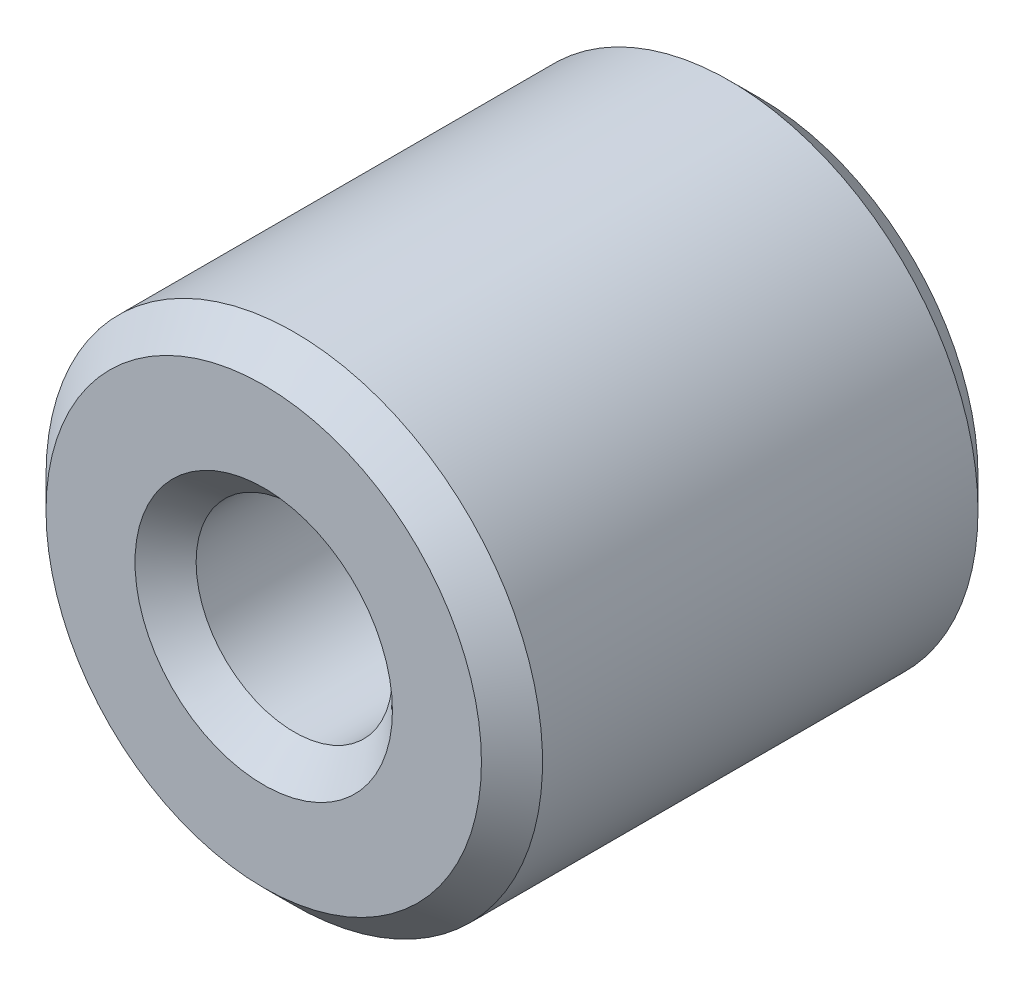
from build123d import *

# Parameters (mm, degrees)
SKETCH1_R           = 6.5
SKETCH1_R_2         = 2.57
BOSS_EXTRUDE1_DEPTH = 13
CHAMFER1_SIZE       = 0.8


with BuildPart() as part:
    # Sketch1 → Boss-Extrude1 (new body)
    with BuildSketch(Plane.XY):
        with Locations(Location((0, 0, 0), (0, 0, 180))):
            Circle(SKETCH1_R)
        with Locations(Location((0, 0, 0), (0, 0, 180))):
            Circle(SKETCH1_R_2, mode=Mode.SUBTRACT)
    extrude(amount=BOSS_EXTRUDE1_DEPTH)

    # Chamfer1
    chamfer1_edges = [part.edges().sort_by_distance(p)[0] for p in [
        (6.5, 0, 0),
        (6.5, 0, 13),
        (2.57, 0, 0),
        (2.57, 0, 13),
    ]]
    chamfer(chamfer1_edges, length=CHAMFER1_SIZE)


solid = part.part
